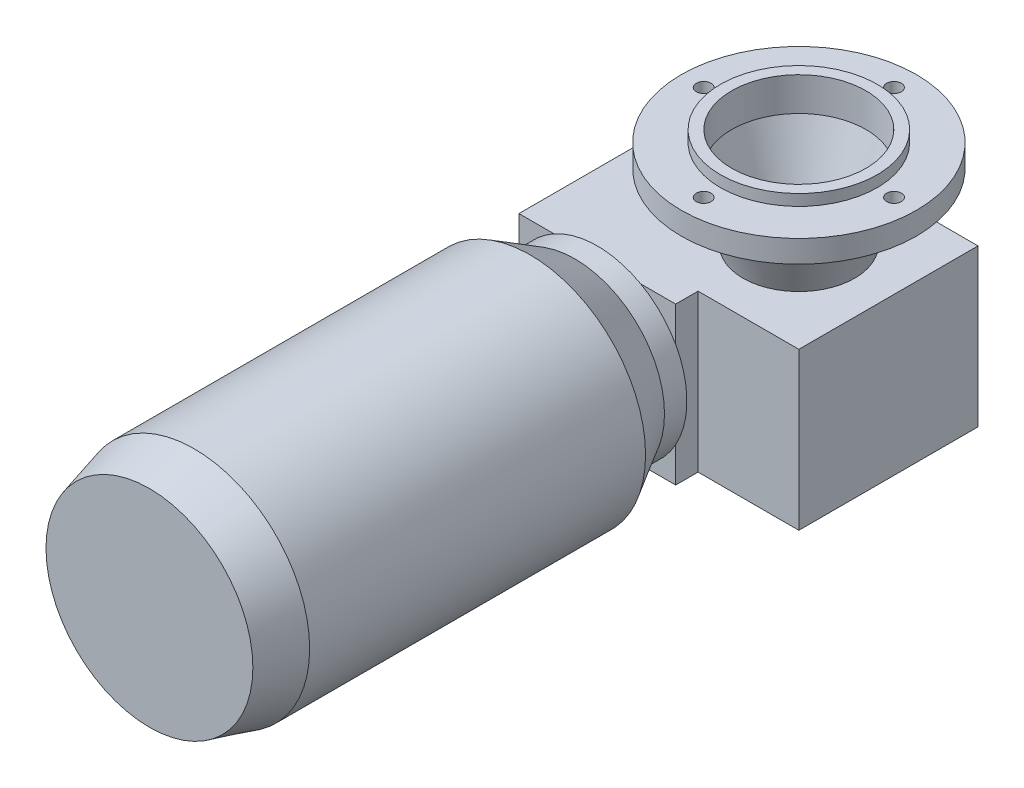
from build123d import *

# Parameters (mm, degrees)
PER_AGE1_D         = 6.6
BOSS_EXTRU_1_DEPTH = 70
ESQUISSE6_R        = 40
BOSS_EXTRU_2_DEPTH = 10
ESQUISSE7_R        = 40
BOSS_EXTRU_3_DEPTH = 20
BOSS_EXTRU_3_DRAFT = -30
ESQUISSE8_R        = 51.547005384
BOSS_EXTRU_4_DEPTH = 150
ESQUISSE9_R        = 51.547005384
BOSS_EXTRU_5_DEPTH = 20
BOSS_EXTRU_5_TAPER = 15
ESQUISSE10_R       = 20
BOSS_EXTRU_6_DEPTH = 5


with BuildPart() as part:
    # Esquisse1 → Base-R_volution (revolve)
    with BuildSketch(Plane.XY, mode=Mode.PRIVATE) as base_r_volution_sk:
        Polygon((30, 0), (35, 0), (35, -5), (52.5, -5), (52.5, -15), (35.8, -15), (25, -45), (0, -45), (0, -40), (21, -40), (30, -15), align=None)
    revolve(base_r_volution_sk.sketch.rotate(Axis((0, 32.384217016, 0), (0, -1, 0)), 90), axis=Axis((0, 32.384217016, 0), (0, -1, 0)))

    # Per_age1 (through all)
    with Locations(Plane(origin=(0, -5, 0), x_dir=(-1, 0, 0), z_dir=(0, 1, 0))):
        with Locations((42.5, 0), (-42.5, 0), (0, -42.5), (0, 42.5)):
            Hole(PER_AGE1_D / 2)

    # Esquisse2 → Boss.-Extru.1 (add)
    with BuildSketch(Plane.XZ.offset(45)):
        Polygon((-5, -40), (-5, -60), (-75, -60), (-75, 50), (-5, 50), (-5, 40), (40, 40), (40, -40), align=None)
    extrude(amount=BOSS_EXTRU_1_DEPTH)

    # Esquisse6 → Boss.-Extru.2 (add)
    with BuildSketch(Plane.XY.offset(50)):
        with Locations(Location((-40, -80, 0), (0, 0, 151.044975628))):
            Circle(ESQUISSE6_R)
    extrude(amount=BOSS_EXTRU_2_DEPTH)


with BuildPart() as boss_extru_3_tool:
    # Esquisse7 → Boss.-Extru.3 (with draft: the straight prism first)
    with BuildSketch(Plane.XY.offset(60)):
        with Locations(Location((-40, -80, 0), (0, 0, 151.044975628))):
            Circle(ESQUISSE7_R)
    extrude(amount=BOSS_EXTRU_3_DEPTH)
    # Boss.-Extru.3: the draft: its side faces are tilted about the plane it starts from
    boss_extru_3_sides = [boss_extru_3_tool.faces().sort_by_distance(p)[0] for p in [
        (-5, -99.364916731, 70),
    ]]
    draft(boss_extru_3_sides, Plane.XY.offset(60), BOSS_EXTRU_3_DRAFT)


with BuildPart() as part_1:
    add(part.part)

    # Boss.-Extru.3: add boss_extru_3_tool
    add(boss_extru_3_tool.part)

    # Esquisse8 → Boss.-Extru.4 (add)
    with BuildSketch(Plane.XY.offset(80)):
        with Locations((-40, -80)):
            Circle(ESQUISSE8_R)
    extrude(amount=BOSS_EXTRU_4_DEPTH)

    # Esquisse9 → Boss.-Extru.5 (add)
    with BuildSketch(Plane.XY.offset(230)):
        with Locations((-40, -80)):
            Circle(ESQUISSE9_R)
    extrude(amount=BOSS_EXTRU_5_DEPTH, taper=BOSS_EXTRU_5_TAPER)

    # Esquisse10 → Boss.-Extru.6 (add)
    with BuildSketch(Plane.XZ.offset(115)):
        with Locations(Location((0, 0, 0), (0, 0, 90))):
            Circle(ESQUISSE10_R)
    extrude(amount=BOSS_EXTRU_6_DEPTH)


solid = part_1.part
